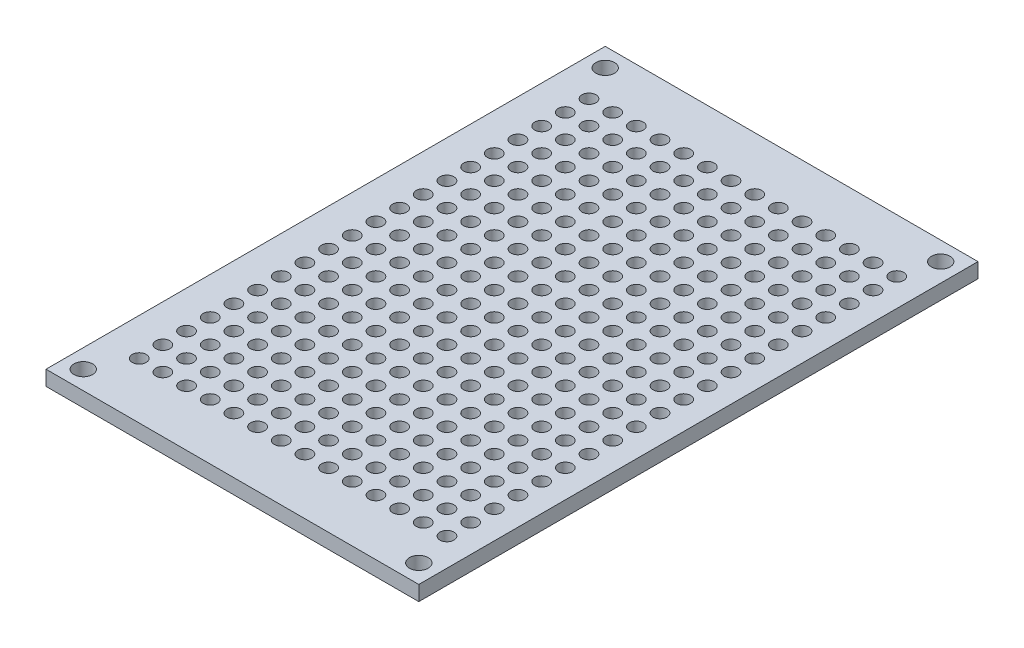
from build123d import *

# Parameters (mm, degrees)
SKETCH1_W            = 40
SKETCH1_H            = 60
BOSS_EXTRUDE1_DEPTH  = 1.6
SKETCH2_R            = 1
CUT_EXTRUDE1_DEPTH   = 20
SKETCH3_R            = 0.75
CUT_EXTRUDE2_DEPTH   = 10
LPATTERN1_COUNT      = 20
LPATTERN1_PITCH      = 2.54
LPATTERN1_COUNT_DIR2 = 14
LPATTERN1_PITCH_DIR2 = 2.54


with BuildPart() as part:
    # Sketch1 → Boss-Extrude1 (new body)
    with BuildSketch(Plane(origin=(0, 0, 0), x_dir=(1, 0, 0), z_dir=(0, 1, 0))):
        with Locations((20, 30)):
            Rectangle(SKETCH1_W, SKETCH1_H)
    extrude(amount=BOSS_EXTRUDE1_DEPTH)

    # Sketch2 → Cut-Extrude1 (cut)
    with BuildSketch(Plane(origin=(0, 1.6, 0), x_dir=(1, 0, 0), z_dir=(0, 1, 0))):
        with Locations(Location((2, 58, 0), (0, 0, 270))):
            Circle(SKETCH2_R)
        with Locations(Location((38, 58, 0), (0, 0, 270))):
            Circle(SKETCH2_R)
        with Locations(Location((2, 2, 0), (0, 0, 270))):
            Circle(SKETCH2_R)
        with Locations(Location((38, 2, 0), (0, 0, 270))):
            Circle(SKETCH2_R)
    extrude(amount=-CUT_EXTRUDE1_DEPTH, mode=Mode.SUBTRACT)

    # Sketch3 → Cut-Extrude2 (cut)
    with BuildSketch(Plane(origin=(0, 1.6, 0), x_dir=(1, 0, 0), z_dir=(0, 1, 0))):
        with Locations(Location((4, 6, 0), (0, 0, 270))):
            Circle(SKETCH3_R)
    cut_extrude2 = extrude(amount=-CUT_EXTRUDE2_DEPTH, mode=Mode.SUBTRACT)

    # LPattern1: Cut-Extrude2 20 × 14
    with Locations(*[(j * LPATTERN1_PITCH_DIR2, 0, -i * LPATTERN1_PITCH) for i in range(LPATTERN1_COUNT) for j in range(LPATTERN1_COUNT_DIR2) if (i, j) != (0, 0)]):
        add(cut_extrude2, mode=Mode.SUBTRACT)


solid = part.part
